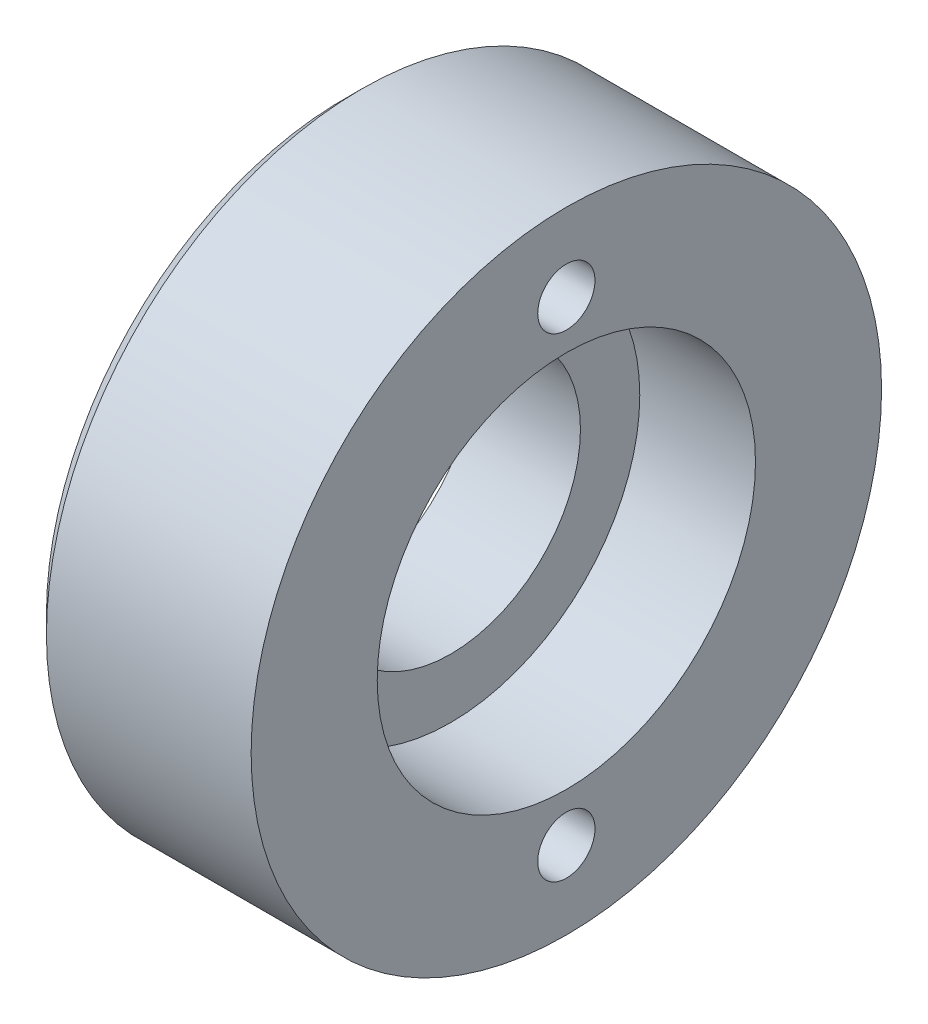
ISO-10303-21;
HEADER;
FILE_DESCRIPTION(('STEP AP214'),'2;1');
FILE_NAME('part.step','',(''),(''),'','','');
FILE_SCHEMA(('AUTOMOTIVE_DESIGN { 1 0 10303 214 1 1 1 1 }'));
ENDSEC;
DATA;
#1=APPLICATION_CONTEXT('core data for automotive mechanical design processes');
#2=APPLICATION_PROTOCOL_DEFINITION('international standard','automotive_design',2000,#1);
#3=PRODUCT_CONTEXT('',#1,'mechanical');
#4=PRODUCT('Part','Part','',(#3));
#5=PRODUCT_RELATED_PRODUCT_CATEGORY('part','',(#4));
#6=PRODUCT_DEFINITION_FORMATION('','',#4);
#7=PRODUCT_DEFINITION_CONTEXT('part definition',#1,'design');
#8=PRODUCT_DEFINITION('design','',#6,#7);
#9=PRODUCT_DEFINITION_SHAPE('','',#8);
#10=(LENGTH_UNIT() NAMED_UNIT(*) SI_UNIT(.MILLI.,.METRE.));
#11=(NAMED_UNIT(*) PLANE_ANGLE_UNIT() SI_UNIT($,.RADIAN.));
#12=(NAMED_UNIT(*) SI_UNIT($,.STERADIAN.) SOLID_ANGLE_UNIT());
#13=UNCERTAINTY_MEASURE_WITH_UNIT(LENGTH_MEASURE(1.E-05),#10,'distance_accuracy_value','');
#14=(GEOMETRIC_REPRESENTATION_CONTEXT(3) GLOBAL_UNCERTAINTY_ASSIGNED_CONTEXT((#13)) GLOBAL_UNIT_ASSIGNED_CONTEXT((#10,
#11,#12)) REPRESENTATION_CONTEXT('',''));
#15=CARTESIAN_POINT('',(0.,0.,0.));
#16=DIRECTION('',(0.,0.,1.));
#17=DIRECTION('',(1.,0.,0.));
#18=AXIS2_PLACEMENT_3D('',#15,#16,#17);
#19=CARTESIAN_POINT('',(0.,-16.1925,0.));
#20=DIRECTION('',(1.,0.,0.));
#21=DIRECTION('',(0.,0.,-1.));
#22=AXIS2_PLACEMENT_3D('',#19,#20,#21);
#23=PLANE('',#22);
#24=CARTESIAN_POINT('',(0.,-20.32,-1.41893883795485E-13));
#25=DIRECTION('',(-1.,0.,0.));
#26=DIRECTION('',(0.,0.,-1.));
#27=AXIS2_PLACEMENT_3D('',#24,#25,#26);
#28=CIRCLE('',#27,2.4511);
#29=CARTESIAN_POINT('',(0.,-20.32,-2.45110000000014));
#30=VERTEX_POINT('',#29);
#31=EDGE_CURVE('E415',#30,#30,#28,.T.);
#32=ORIENTED_EDGE('',*,*,#31,.T.);
#33=EDGE_LOOP('',(#32));
#34=FACE_BOUND('',#33,.T.);
#35=CARTESIAN_POINT('',(0.,20.32,0.));
#36=DIRECTION('',(-1.,0.,0.));
#37=DIRECTION('',(0.,0.,1.));
#38=AXIS2_PLACEMENT_3D('',#35,#36,#37);
#39=CIRCLE('',#38,2.4511);
#40=CARTESIAN_POINT('',(0.,20.32,2.4511));
#41=VERTEX_POINT('',#40);
#42=EDGE_CURVE('E409',#41,#41,#39,.T.);
#43=ORIENTED_EDGE('',*,*,#42,.T.);
#44=EDGE_LOOP('',(#43));
#45=FACE_BOUND('',#44,.T.);
#46=CARTESIAN_POINT('',(0.,0.,0.));
#47=DIRECTION('',(-1.,0.,0.));
#48=DIRECTION('',(0.,0.,1.));
#49=AXIS2_PLACEMENT_3D('',#46,#47,#48);
#50=CIRCLE('',#49,16.1925);
#51=CARTESIAN_POINT('',(0.,0.,16.1925));
#52=VERTEX_POINT('',#51);
#53=EDGE_CURVE('E406',#52,#52,#50,.T.);
#54=ORIENTED_EDGE('',*,*,#53,.T.);
#55=EDGE_LOOP('',(#54));
#56=FACE_BOUND('',#55,.T.);
#57=CARTESIAN_POINT('',(0.,0.,0.));
#58=DIRECTION('',(-1.,0.,0.));
#59=DIRECTION('',(0.,0.,1.));
#60=AXIS2_PLACEMENT_3D('',#57,#58,#59);
#61=CIRCLE('',#60,26.9875);
#62=CARTESIAN_POINT('',(0.,0.,26.9875));
#63=VERTEX_POINT('',#62);
#64=EDGE_CURVE('E391',#63,#63,#61,.T.);
#65=ORIENTED_EDGE('',*,*,#64,.F.);
#66=EDGE_LOOP('',(#65));
#67=FACE_BOUND('',#66,.T.);
#68=ADVANCED_FACE('F381',(#34,#45,#56,#67),#23,.T.);
#69=CARTESIAN_POINT('',(0.,0.,0.));
#70=DIRECTION('',(-1.,0.,0.));
#71=DIRECTION('',(0.,0.,1.));
#72=AXIS2_PLACEMENT_3D('',#69,#70,#71);
#73=CYLINDRICAL_SURFACE('',#72,26.9875);
#74=CARTESIAN_POINT('',(-17.526,0.,0.));
#75=DIRECTION('',(-1.,0.,0.));
#76=DIRECTION('',(0.,0.,1.));
#77=AXIS2_PLACEMENT_3D('',#74,#75,#76);
#78=CIRCLE('',#77,26.9875);
#79=CARTESIAN_POINT('',(-17.526,0.,26.9875));
#80=VERTEX_POINT('',#79);
#81=EDGE_CURVE('E10',#80,#80,#78,.F.);
#82=ORIENTED_EDGE('',*,*,#81,.T.);
#83=EDGE_LOOP('',(#82));
#84=FACE_BOUND('',#83,.T.);
#85=ORIENTED_EDGE('',*,*,#64,.T.);
#86=EDGE_LOOP('',(#85));
#87=FACE_BOUND('',#86,.T.);
#88=ADVANCED_FACE('F428',(#84,#87),#73,.T.);
#89=CARTESIAN_POINT('',(-19.05,-11.1125,0.));
#90=DIRECTION('',(-1.,0.,0.));
#91=DIRECTION('',(0.,0.,1.));
#92=AXIS2_PLACEMENT_3D('',#89,#90,#91);
#93=PLANE('',#92);
#94=CARTESIAN_POINT('',(-19.05,0.,0.));
#95=DIRECTION('',(-1.,0.,0.));
#96=DIRECTION('',(0.,0.,1.));
#97=AXIS2_PLACEMENT_3D('',#94,#95,#96);
#98=CIRCLE('',#97,25.4635);
#99=CARTESIAN_POINT('',(-19.05,0.,25.4635));
#100=VERTEX_POINT('',#99);
#101=EDGE_CURVE('E387',#100,#100,#98,.T.);
#102=ORIENTED_EDGE('',*,*,#101,.T.);
#103=EDGE_LOOP('',(#102));
#104=FACE_BOUND('',#103,.T.);
#105=CARTESIAN_POINT('',(-19.05,-20.32,-1.41893883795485E-13));
#106=DIRECTION('',(-1.,0.,0.));
#107=DIRECTION('',(0.,0.,-1.));
#108=AXIS2_PLACEMENT_3D('',#105,#106,#107);
#109=CIRCLE('',#108,2.4511);
#110=CARTESIAN_POINT('',(-19.05,-20.32,-2.45110000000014));
#111=VERTEX_POINT('',#110);
#112=EDGE_CURVE('E418',#111,#111,#109,.T.);
#113=ORIENTED_EDGE('',*,*,#112,.F.);
#114=EDGE_LOOP('',(#113));
#115=FACE_BOUND('',#114,.T.);
#116=CARTESIAN_POINT('',(-19.05,20.32,0.));
#117=DIRECTION('',(-1.,0.,0.));
#118=DIRECTION('',(0.,0.,1.));
#119=AXIS2_PLACEMENT_3D('',#116,#117,#118);
#120=CIRCLE('',#119,2.4511);
#121=CARTESIAN_POINT('',(-19.05,20.32,2.4511));
#122=VERTEX_POINT('',#121);
#123=EDGE_CURVE('E412',#122,#122,#120,.T.);
#124=ORIENTED_EDGE('',*,*,#123,.F.);
#125=EDGE_LOOP('',(#124));
#126=FACE_BOUND('',#125,.T.);
#127=CARTESIAN_POINT('',(-19.05,0.,0.));
#128=DIRECTION('',(-1.,0.,0.));
#129=DIRECTION('',(0.,0.,1.));
#130=AXIS2_PLACEMENT_3D('',#127,#128,#129);
#131=CIRCLE('',#130,11.1125);
#132=CARTESIAN_POINT('',(-19.05,0.,11.1125));
#133=VERTEX_POINT('',#132);
#134=EDGE_CURVE('E395',#133,#133,#131,.T.);
#135=ORIENTED_EDGE('',*,*,#134,.F.);
#136=EDGE_LOOP('',(#135));
#137=FACE_BOUND('',#136,.T.);
#138=ADVANCED_FACE('F424',(#104,#115,#126,#137),#93,.T.);
#139=CARTESIAN_POINT('',(0.,0.,0.));
#140=DIRECTION('',(-1.,0.,0.));
#141=DIRECTION('',(0.,0.,1.));
#142=AXIS2_PLACEMENT_3D('',#139,#140,#141);
#143=CYLINDRICAL_SURFACE('',#142,11.1125);
#144=ORIENTED_EDGE('',*,*,#134,.T.);
#145=EDGE_LOOP('',(#144));
#146=FACE_BOUND('',#145,.T.);
#147=CARTESIAN_POINT('',(-9.906,0.,0.));
#148=DIRECTION('',(-1.,0.,0.));
#149=DIRECTION('',(0.,0.,1.));
#150=AXIS2_PLACEMENT_3D('',#147,#148,#149);
#151=CIRCLE('',#150,11.1125);
#152=CARTESIAN_POINT('',(-9.906,0.,11.1125));
#153=VERTEX_POINT('',#152);
#154=EDGE_CURVE('E400',#153,#153,#151,.T.);
#155=ORIENTED_EDGE('',*,*,#154,.F.);
#156=EDGE_LOOP('',(#155));
#157=FACE_BOUND('',#156,.T.);
#158=ADVANCED_FACE('F427',(#146,#157),#143,.F.);
#159=CARTESIAN_POINT('',(-9.906,-16.1925,0.));
#160=DIRECTION('',(1.,0.,0.));
#161=DIRECTION('',(0.,0.,-1.));
#162=AXIS2_PLACEMENT_3D('',#159,#160,#161);
#163=PLANE('',#162);
#164=ORIENTED_EDGE('',*,*,#154,.T.);
#165=EDGE_LOOP('',(#164));
#166=FACE_BOUND('',#165,.T.);
#167=CARTESIAN_POINT('',(-9.906,0.,0.));
#168=DIRECTION('',(-1.,0.,0.));
#169=DIRECTION('',(0.,0.,1.));
#170=AXIS2_PLACEMENT_3D('',#167,#168,#169);
#171=CIRCLE('',#170,16.1925);
#172=CARTESIAN_POINT('',(-9.906,0.,16.1925));
#173=VERTEX_POINT('',#172);
#174=EDGE_CURVE('E403',#173,#173,#171,.T.);
#175=ORIENTED_EDGE('',*,*,#174,.F.);
#176=EDGE_LOOP('',(#175));
#177=FACE_BOUND('',#176,.T.);
#178=ADVANCED_FACE('F436',(#166,#177),#163,.T.);
#179=CARTESIAN_POINT('',(0.,0.,0.));
#180=DIRECTION('',(-1.,0.,0.));
#181=DIRECTION('',(0.,0.,1.));
#182=AXIS2_PLACEMENT_3D('',#179,#180,#181);
#183=CYLINDRICAL_SURFACE('',#182,16.1925);
#184=ORIENTED_EDGE('',*,*,#174,.T.);
#185=EDGE_LOOP('',(#184));
#186=FACE_BOUND('',#185,.T.);
#187=ORIENTED_EDGE('',*,*,#53,.F.);
#188=EDGE_LOOP('',(#187));
#189=FACE_BOUND('',#188,.T.);
#190=ADVANCED_FACE('F442',(#186,#189),#183,.F.);
#191=CARTESIAN_POINT('',(0.,20.32,0.));
#192=DIRECTION('',(-1.,0.,0.));
#193=DIRECTION('',(0.,0.,1.));
#194=AXIS2_PLACEMENT_3D('',#191,#192,#193);
#195=CYLINDRICAL_SURFACE('',#194,2.4511);
#196=ORIENTED_EDGE('',*,*,#42,.F.);
#197=EDGE_LOOP('',(#196));
#198=FACE_BOUND('',#197,.T.);
#199=ORIENTED_EDGE('',*,*,#123,.T.);
#200=EDGE_LOOP('',(#199));
#201=FACE_BOUND('',#200,.T.);
#202=ADVANCED_FACE('F448',(#198,#201),#195,.F.);
#203=CARTESIAN_POINT('',(0.,-20.32,-1.41893883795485E-13));
#204=DIRECTION('',(-1.,0.,0.));
#205=DIRECTION('',(0.,0.,1.));
#206=AXIS2_PLACEMENT_3D('',#203,#204,#205);
#207=CYLINDRICAL_SURFACE('',#206,2.4511);
#208=ORIENTED_EDGE('',*,*,#31,.F.);
#209=EDGE_LOOP('',(#208));
#210=FACE_BOUND('',#209,.T.);
#211=ORIENTED_EDGE('',*,*,#112,.T.);
#212=EDGE_LOOP('',(#211));
#213=FACE_BOUND('',#212,.T.);
#214=ADVANCED_FACE('F422',(#210,#213),#207,.F.);
#215=CARTESIAN_POINT('',(-19.05,0.,0.));
#216=DIRECTION('',(1.,0.,0.));
#217=DIRECTION('',(0.,0.,-1.));
#218=AXIS2_PLACEMENT_3D('',#215,#216,#217);
#219=CONICAL_SURFACE('',#218,25.4635,0.785398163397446);
#220=ORIENTED_EDGE('',*,*,#81,.F.);
#221=EDGE_LOOP('',(#220));
#222=FACE_BOUND('',#221,.T.);
#223=ORIENTED_EDGE('',*,*,#101,.F.);
#224=EDGE_LOOP('',(#223));
#225=FACE_BOUND('',#224,.T.);
#226=ADVANCED_FACE('F466',(#222,#225),#219,.T.);
#227=CLOSED_SHELL('',(#68,#88,#138,#158,#178,#190,#202,#214,#226));
#228=MANIFOLD_SOLID_BREP('B2',#227);
#229=ADVANCED_BREP_SHAPE_REPRESENTATION('',(#18,#228),#14);
#230=SHAPE_DEFINITION_REPRESENTATION(#9,#229);
ENDSEC;
END-ISO-10303-21;
